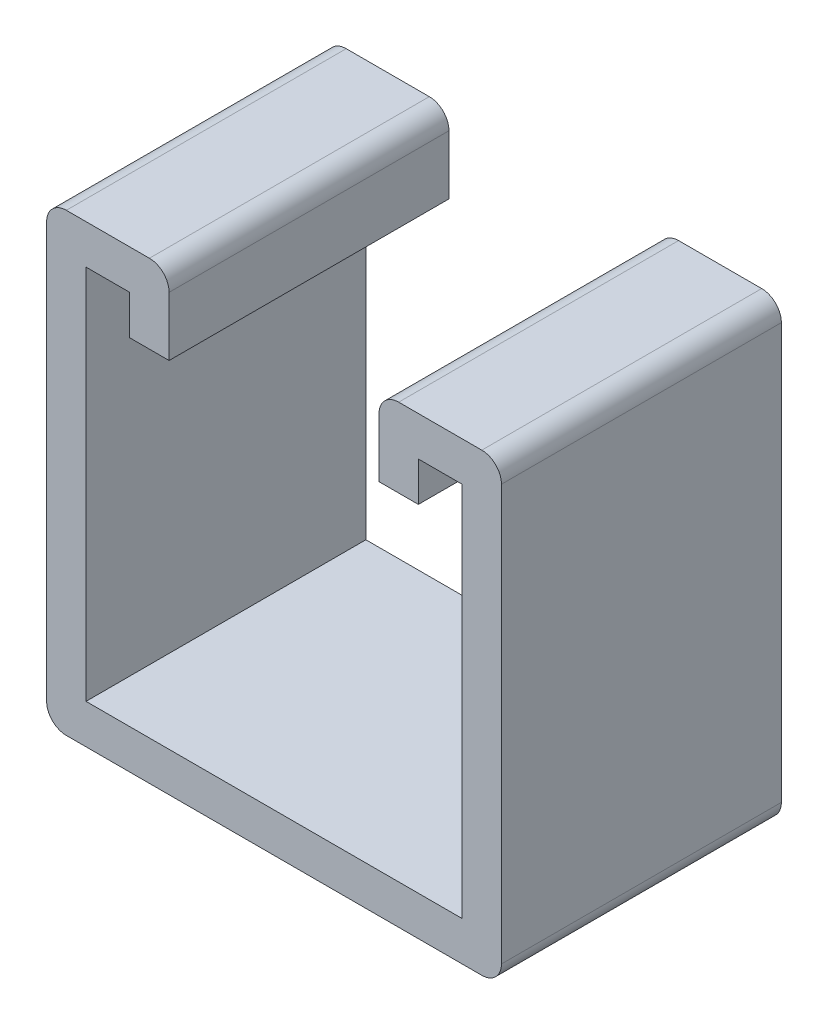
from build123d import *

# Parameters (mm, degrees)
BASE_EXTRUDE_DEPTH = 12.7


with BuildPart() as part:
    # Sketch1 → Base-Extrude (new, symmetric)
    with BuildSketch(Plane.XY):
        with BuildLine():
            Line((-11.3109375, 20.6375), (-18.8515625, 20.6375))
            ThreePointArc((-18.8515625, 20.6375), (-20.114411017, 20.114411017), (-20.6375, 18.8515625))
            Line((-20.6375, 18.8515625), (-20.6375, -18.8515625))
            ThreePointArc((-20.6375, -18.8515625), (-20.114411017, -20.114411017), (-18.8515625, -20.6375))
            Line((-18.8515625, -20.6375), (18.8515625, -20.6375))
            ThreePointArc((18.8515625, -20.6375), (20.114411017, -20.114411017), (20.6375, -18.8515625))
            Line((20.6375, -18.8515625), (20.6375, 18.8515625))
            ThreePointArc((20.6375, 18.8515625), (20.114411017, 20.114411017), (18.8515625, 20.6375))
            Line((18.8515625, 20.6375), (11.3109375, 20.6375))
            ThreePointArc((11.3109375, 20.6375), (10.048088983, 20.114411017), (9.525, 18.8515625))
            Line((9.525, 18.8515625), (9.525, 13.49375))
            Line((9.525, 13.49375), (13.096875, 13.49375))
            Line((13.096875, 13.49375), (13.096875, 17.065625))
            Line((13.096875, 17.065625), (17.065625, 17.065625))
            Line((17.065625, 17.065625), (17.065625, -17.065625))
            Line((17.065625, -17.065625), (-17.065625, -17.065625))
            Line((-17.065625, -17.065625), (-17.065625, 17.065625))
            Line((-17.065625, 17.065625), (-13.096875, 17.065625))
            Line((-13.096875, 17.065625), (-13.096875, 13.49375))
            Line((-13.096875, 13.49375), (-9.525, 13.49375))
            Line((-9.525, 13.49375), (-9.525, 18.8515625))
            ThreePointArc((-9.525, 18.8515625), (-10.048088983, 20.114411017), (-11.3109375, 20.6375))
        make_face()
    extrude(amount=BASE_EXTRUDE_DEPTH, both=True)


solid = part.part
